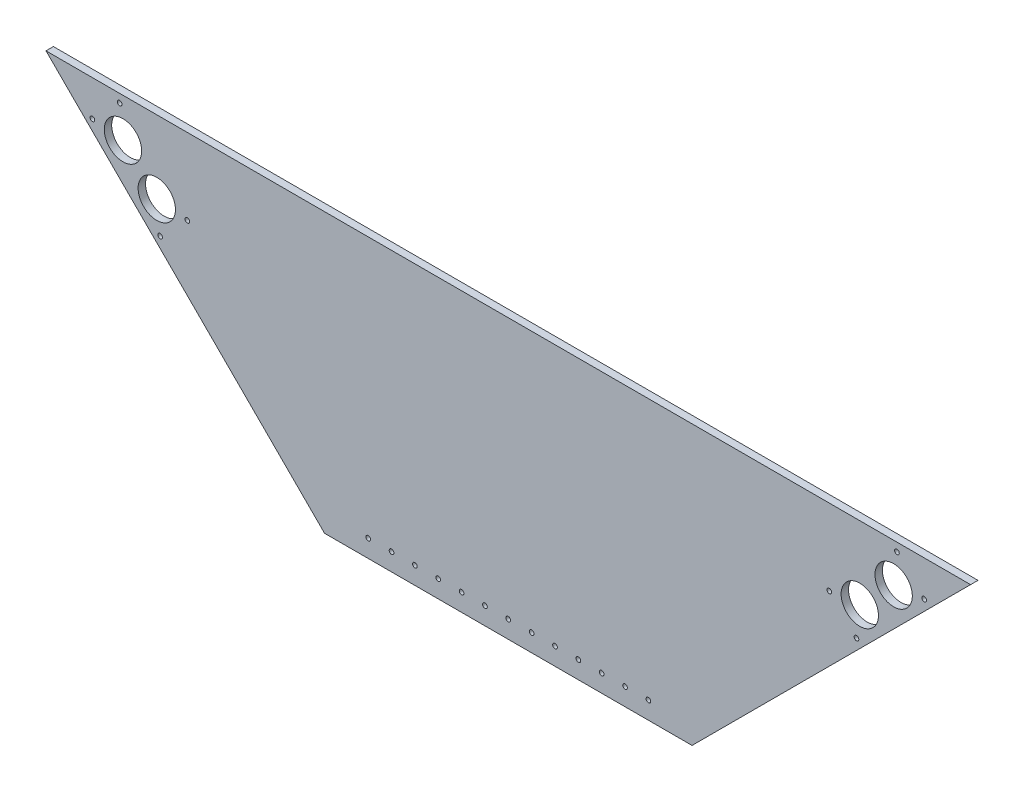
ISO-10303-21;
HEADER;
FILE_DESCRIPTION(('STEP AP214'),'2;1');
FILE_NAME('part.step','',(''),(''),'','','');
FILE_SCHEMA(('AUTOMOTIVE_DESIGN { 1 0 10303 214 1 1 1 1 }'));
ENDSEC;
DATA;
#1=APPLICATION_CONTEXT('core data for automotive mechanical design processes');
#2=APPLICATION_PROTOCOL_DEFINITION('international standard','automotive_design',2000,#1);
#3=PRODUCT_CONTEXT('',#1,'mechanical');
#4=PRODUCT('Part','Part','',(#3));
#5=PRODUCT_RELATED_PRODUCT_CATEGORY('part','',(#4));
#6=PRODUCT_DEFINITION_FORMATION('','',#4);
#7=PRODUCT_DEFINITION_CONTEXT('part definition',#1,'design');
#8=PRODUCT_DEFINITION('design','',#6,#7);
#9=PRODUCT_DEFINITION_SHAPE('','',#8);
#10=(LENGTH_UNIT() NAMED_UNIT(*) SI_UNIT(.MILLI.,.METRE.));
#11=(NAMED_UNIT(*) PLANE_ANGLE_UNIT() SI_UNIT($,.RADIAN.));
#12=(NAMED_UNIT(*) SI_UNIT($,.STERADIAN.) SOLID_ANGLE_UNIT());
#13=UNCERTAINTY_MEASURE_WITH_UNIT(LENGTH_MEASURE(1.E-05),#10,'distance_accuracy_value','');
#14=(GEOMETRIC_REPRESENTATION_CONTEXT(3) GLOBAL_UNCERTAINTY_ASSIGNED_CONTEXT((#13)) GLOBAL_UNIT_ASSIGNED_CONTEXT((#10,
#11,#12)) REPRESENTATION_CONTEXT('',''));
#15=CARTESIAN_POINT('',(0.,0.,0.));
#16=DIRECTION('',(0.,0.,1.));
#17=DIRECTION('',(1.,0.,0.));
#18=AXIS2_PLACEMENT_3D('',#15,#16,#17);
#19=CARTESIAN_POINT('',(-197.965,119.28,3.175));
#20=DIRECTION('',(0.,1.,0.));
#21=DIRECTION('',(-1.,0.,0.));
#22=AXIS2_PLACEMENT_3D('',#19,#20,#21);
#23=PLANE('',#22);
#24=DIRECTION('',(1.,0.,0.));
#25=VECTOR('',#24,1.);
#26=CARTESIAN_POINT('',(-197.965,119.28,0.));
#27=LINE('',#26,#25);
#28=CARTESIAN_POINT('',(-197.965,119.28,0.));
#29=VERTEX_POINT('',#28);
#30=CARTESIAN_POINT('',(197.965,119.28,0.));
#31=VERTEX_POINT('',#30);
#32=EDGE_CURVE('E112',#29,#31,#27,.T.);
#33=ORIENTED_EDGE('',*,*,#32,.F.);
#34=DIRECTION('',(0.,0.,-1.));
#35=VECTOR('',#34,1.);
#36=CARTESIAN_POINT('',(-197.965,119.28,3.175));
#37=LINE('',#36,#35);
#38=CARTESIAN_POINT('',(-197.965,119.28,3.175));
#39=VERTEX_POINT('',#38);
#40=EDGE_CURVE('E11',#39,#29,#37,.T.);
#41=ORIENTED_EDGE('',*,*,#40,.F.);
#42=DIRECTION('',(1.,0.,0.));
#43=VECTOR('',#42,1.);
#44=CARTESIAN_POINT('',(-197.965,119.28,3.175));
#45=LINE('',#44,#43);
#46=CARTESIAN_POINT('',(197.965,119.28,3.175));
#47=VERTEX_POINT('',#46);
#48=EDGE_CURVE('E104',#39,#47,#45,.T.);
#49=ORIENTED_EDGE('',*,*,#48,.T.);
#50=DIRECTION('',(0.,0.,-1.));
#51=VECTOR('',#50,1.);
#52=CARTESIAN_POINT('',(197.965,119.28,3.175));
#53=LINE('',#52,#51);
#54=EDGE_CURVE('E43',#47,#31,#53,.T.);
#55=ORIENTED_EDGE('',*,*,#54,.T.);
#56=EDGE_LOOP('',(#33,#41,#49,#55));
#57=FACE_BOUND('',#56,.T.);
#58=ADVANCED_FACE('F40',(#57),#23,.T.);
#59=CARTESIAN_POINT('',(-197.965,119.28,3.175));
#60=DIRECTION('',(0.707106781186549,0.707106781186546,0.));
#61=DIRECTION('',(-0.707106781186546,0.707106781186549,0.));
#62=AXIS2_PLACEMENT_3D('',#59,#60,#61);
#63=PLANE('',#62);
#64=DIRECTION('',(0.707106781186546,-0.707106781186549,0.));
#65=VECTOR('',#64,1.);
#66=CARTESIAN_POINT('',(-197.965,119.28,0.));
#67=LINE('',#66,#65);
#68=CARTESIAN_POINT('',(-78.685,0.,0.));
#69=VERTEX_POINT('',#68);
#70=EDGE_CURVE('E74',#29,#69,#67,.T.);
#71=ORIENTED_EDGE('',*,*,#70,.T.);
#72=DIRECTION('',(0.,0.,-1.));
#73=VECTOR('',#72,1.);
#74=CARTESIAN_POINT('',(-78.685,0.,3.175));
#75=LINE('',#74,#73);
#76=CARTESIAN_POINT('',(-78.685,0.,3.175));
#77=VERTEX_POINT('',#76);
#78=EDGE_CURVE('E50',#77,#69,#75,.T.);
#79=ORIENTED_EDGE('',*,*,#78,.F.);
#80=DIRECTION('',(0.707106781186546,-0.707106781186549,0.));
#81=VECTOR('',#80,1.);
#82=CARTESIAN_POINT('',(-197.965,119.28,3.175));
#83=LINE('',#82,#81);
#84=EDGE_CURVE('E91',#39,#77,#83,.T.);
#85=ORIENTED_EDGE('',*,*,#84,.F.);
#86=ORIENTED_EDGE('',*,*,#40,.T.);
#87=EDGE_LOOP('',(#71,#79,#85,#86));
#88=FACE_BOUND('',#87,.T.);
#89=ADVANCED_FACE('F129',(#88),#63,.F.);
#90=CARTESIAN_POINT('',(-78.685,0.,3.175));
#91=DIRECTION('',(0.,1.,0.));
#92=DIRECTION('',(-1.,0.,0.));
#93=AXIS2_PLACEMENT_3D('',#90,#91,#92);
#94=PLANE('',#93);
#95=DIRECTION('',(1.,0.,0.));
#96=VECTOR('',#95,1.);
#97=CARTESIAN_POINT('',(-78.685,0.,0.));
#98=LINE('',#97,#96);
#99=CARTESIAN_POINT('',(78.685,0.,0.));
#100=VERTEX_POINT('',#99);
#101=EDGE_CURVE('E99',#69,#100,#98,.T.);
#102=ORIENTED_EDGE('',*,*,#101,.T.);
#103=DIRECTION('',(0.,0.,-1.));
#104=VECTOR('',#103,1.);
#105=CARTESIAN_POINT('',(78.685,0.,3.175));
#106=LINE('',#105,#104);
#107=CARTESIAN_POINT('',(78.685,0.,3.175));
#108=VERTEX_POINT('',#107);
#109=EDGE_CURVE('E96',#108,#100,#106,.T.);
#110=ORIENTED_EDGE('',*,*,#109,.F.);
#111=DIRECTION('',(1.,0.,0.));
#112=VECTOR('',#111,1.);
#113=CARTESIAN_POINT('',(-78.685,0.,3.175));
#114=LINE('',#113,#112);
#115=EDGE_CURVE('E86',#77,#108,#114,.T.);
#116=ORIENTED_EDGE('',*,*,#115,.F.);
#117=ORIENTED_EDGE('',*,*,#78,.T.);
#118=EDGE_LOOP('',(#102,#110,#116,#117));
#119=FACE_BOUND('',#118,.T.);
#120=ADVANCED_FACE('F97',(#119),#94,.F.);
#121=CARTESIAN_POINT('',(197.965,119.28,3.175));
#122=DIRECTION('',(0.707106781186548,-0.707106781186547,0.));
#123=DIRECTION('',(0.707106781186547,0.707106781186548,0.));
#124=AXIS2_PLACEMENT_3D('',#121,#122,#123);
#125=PLANE('',#124);
#126=DIRECTION('',(-0.707106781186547,-0.707106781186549,0.));
#127=VECTOR('',#126,1.);
#128=CARTESIAN_POINT('',(197.965,119.28,0.));
#129=LINE('',#128,#127);
#130=EDGE_CURVE('E116',#31,#100,#129,.T.);
#131=ORIENTED_EDGE('',*,*,#130,.F.);
#132=ORIENTED_EDGE('',*,*,#54,.F.);
#133=DIRECTION('',(-0.707106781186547,-0.707106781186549,0.));
#134=VECTOR('',#133,1.);
#135=CARTESIAN_POINT('',(197.965,119.28,3.175));
#136=LINE('',#135,#134);
#137=EDGE_CURVE('E90',#47,#108,#136,.T.);
#138=ORIENTED_EDGE('',*,*,#137,.T.);
#139=ORIENTED_EDGE('',*,*,#109,.T.);
#140=EDGE_LOOP('',(#131,#132,#138,#139));
#141=FACE_BOUND('',#140,.T.);
#142=ADVANCED_FACE('F102',(#141),#125,.T.);
#143=CARTESIAN_POINT('',(0.,0.,3.175));
#144=DIRECTION('',(0.,0.,-1.));
#145=DIRECTION('',(-1.,0.,0.));
#146=AXIS2_PLACEMENT_3D('',#143,#144,#145);
#147=PLANE('',#146);
#148=CARTESIAN_POINT('',(178.096235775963,104.0032301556,3.175));
#149=DIRECTION('',(0.,0.,-1.));
#150=DIRECTION('',(-1.,0.,0.));
#151=AXIS2_PLACEMENT_3D('',#148,#149,#150);
#152=CIRCLE('',#151,0.999999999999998);
#153=CARTESIAN_POINT('',(177.096235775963,104.0032301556,3.175));
#154=VERTEX_POINT('',#153);
#155=EDGE_CURVE('E273',#154,#154,#152,.T.);
#156=ORIENTED_EDGE('',*,*,#155,.T.);
#157=EDGE_LOOP('',(#156));
#158=FACE_BOUND('',#157,.T.);
#159=CARTESIAN_POINT('',(166.428973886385,115.670492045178,3.175));
#160=DIRECTION('',(0.,0.,-1.));
#161=DIRECTION('',(-1.,0.,0.));
#162=AXIS2_PLACEMENT_3D('',#159,#160,#161);
#163=CIRCLE('',#162,0.999999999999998);
#164=CARTESIAN_POINT('',(165.428973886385,115.670492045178,3.175));
#165=VERTEX_POINT('',#164);
#166=EDGE_CURVE('E280',#165,#165,#163,.T.);
#167=ORIENTED_EDGE('',*,*,#166,.T.);
#168=EDGE_LOOP('',(#167));
#169=FACE_BOUND('',#168,.T.);
#170=CARTESIAN_POINT('',(137.437595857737,86.6791140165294,3.175));
#171=DIRECTION('',(0.,0.,-1.));
#172=DIRECTION('',(1.,0.,0.));
#173=AXIS2_PLACEMENT_3D('',#170,#171,#172);
#174=CIRCLE('',#173,1.00000000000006);
#175=CARTESIAN_POINT('',(138.437595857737,86.6791140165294,3.175));
#176=VERTEX_POINT('',#175);
#177=EDGE_CURVE('E288',#176,#176,#174,.T.);
#178=ORIENTED_EDGE('',*,*,#177,.T.);
#179=EDGE_LOOP('',(#178));
#180=FACE_BOUND('',#179,.T.);
#181=CARTESIAN_POINT('',(149.104857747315,75.0118521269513,3.175));
#182=DIRECTION('',(0.,0.,-1.));
#183=DIRECTION('',(1.,0.,0.));
#184=AXIS2_PLACEMENT_3D('',#181,#182,#183);
#185=CIRCLE('',#184,1.00000000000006);
#186=CARTESIAN_POINT('',(150.104857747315,75.0118521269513,3.175));
#187=VERTEX_POINT('',#186);
#188=EDGE_CURVE('E265',#187,#187,#185,.T.);
#189=ORIENTED_EDGE('',*,*,#188,.T.);
#190=EDGE_LOOP('',(#189));
#191=FACE_BOUND('',#190,.T.);
#192=CARTESIAN_POINT('',(150.519071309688,88.0933275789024,3.175));
#193=DIRECTION('',(0.,0.,-1.));
#194=DIRECTION('',(1.,0.,0.));
#195=AXIS2_PLACEMENT_3D('',#192,#193,#194);
#196=CIRCLE('',#195,8.00000000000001);
#197=CARTESIAN_POINT('',(158.519071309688,88.0933275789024,3.175));
#198=VERTEX_POINT('',#197);
#199=EDGE_CURVE('E260',#198,#198,#196,.T.);
#200=ORIENTED_EDGE('',*,*,#199,.T.);
#201=EDGE_LOOP('',(#200));
#202=FACE_BOUND('',#201,.T.);
#203=CARTESIAN_POINT('',(165.014760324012,102.589016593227,3.175));
#204=DIRECTION('',(0.,0.,-1.));
#205=DIRECTION('',(-1.,0.,0.));
#206=AXIS2_PLACEMENT_3D('',#203,#204,#205);
#207=CIRCLE('',#206,8.00000000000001);
#208=CARTESIAN_POINT('',(157.014760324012,102.589016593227,3.175));
#209=VERTEX_POINT('',#208);
#210=EDGE_CURVE('E272',#209,#209,#207,.T.);
#211=ORIENTED_EDGE('',*,*,#210,.T.);
#212=EDGE_LOOP('',(#211));
#213=FACE_BOUND('',#212,.T.);
#214=CARTESIAN_POINT('',(-178.096235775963,104.0032301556,3.175));
#215=DIRECTION('',(0.,0.,1.));
#216=DIRECTION('',(1.,0.,0.));
#217=AXIS2_PLACEMENT_3D('',#214,#215,#216);
#218=CIRCLE('',#217,0.999999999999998);
#219=CARTESIAN_POINT('',(-177.096235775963,104.0032301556,3.175));
#220=VERTEX_POINT('',#219);
#221=EDGE_CURVE('E320',#220,#220,#218,.T.);
#222=ORIENTED_EDGE('',*,*,#221,.F.);
#223=EDGE_LOOP('',(#222));
#224=FACE_BOUND('',#223,.T.);
#225=CARTESIAN_POINT('',(-166.428973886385,115.670492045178,3.175));
#226=DIRECTION('',(0.,0.,1.));
#227=DIRECTION('',(1.,0.,0.));
#228=AXIS2_PLACEMENT_3D('',#225,#226,#227);
#229=CIRCLE('',#228,0.999999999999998);
#230=CARTESIAN_POINT('',(-165.428973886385,115.670492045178,3.175));
#231=VERTEX_POINT('',#230);
#232=EDGE_CURVE('E328',#231,#231,#229,.T.);
#233=ORIENTED_EDGE('',*,*,#232,.F.);
#234=EDGE_LOOP('',(#233));
#235=FACE_BOUND('',#234,.T.);
#236=CARTESIAN_POINT('',(-137.437595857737,86.6791140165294,3.175));
#237=DIRECTION('',(0.,0.,1.));
#238=DIRECTION('',(-1.,0.,0.));
#239=AXIS2_PLACEMENT_3D('',#236,#237,#238);
#240=CIRCLE('',#239,1.00000000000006);
#241=CARTESIAN_POINT('',(-138.437595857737,86.6791140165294,3.175));
#242=VERTEX_POINT('',#241);
#243=EDGE_CURVE('E336',#242,#242,#240,.T.);
#244=ORIENTED_EDGE('',*,*,#243,.F.);
#245=EDGE_LOOP('',(#244));
#246=FACE_BOUND('',#245,.T.);
#247=CARTESIAN_POINT('',(-149.104857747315,75.0118521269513,3.175));
#248=DIRECTION('',(0.,0.,1.));
#249=DIRECTION('',(-1.,0.,0.));
#250=AXIS2_PLACEMENT_3D('',#247,#248,#249);
#251=CIRCLE('',#250,1.00000000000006);
#252=CARTESIAN_POINT('',(-150.104857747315,75.0118521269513,3.175));
#253=VERTEX_POINT('',#252);
#254=EDGE_CURVE('E311',#253,#253,#251,.T.);
#255=ORIENTED_EDGE('',*,*,#254,.F.);
#256=EDGE_LOOP('',(#255));
#257=FACE_BOUND('',#256,.T.);
#258=CARTESIAN_POINT('',(-150.519071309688,88.0933275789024,3.175));
#259=DIRECTION('',(0.,0.,1.));
#260=DIRECTION('',(-1.,0.,0.));
#261=AXIS2_PLACEMENT_3D('',#258,#259,#260);
#262=CIRCLE('',#261,8.00000000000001);
#263=CARTESIAN_POINT('',(-158.519071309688,88.0933275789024,3.175));
#264=VERTEX_POINT('',#263);
#265=EDGE_CURVE('E303',#264,#264,#262,.T.);
#266=ORIENTED_EDGE('',*,*,#265,.F.);
#267=EDGE_LOOP('',(#266));
#268=FACE_BOUND('',#267,.T.);
#269=CARTESIAN_POINT('',(-165.014760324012,102.589016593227,3.175));
#270=DIRECTION('',(0.,0.,1.));
#271=DIRECTION('',(1.,0.,0.));
#272=AXIS2_PLACEMENT_3D('',#269,#270,#271);
#273=CIRCLE('',#272,8.00000000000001);
#274=CARTESIAN_POINT('',(-157.014760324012,102.589016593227,3.175));
#275=VERTEX_POINT('',#274);
#276=EDGE_CURVE('E319',#275,#275,#273,.T.);
#277=ORIENTED_EDGE('',*,*,#276,.F.);
#278=EDGE_LOOP('',(#277));
#279=FACE_BOUND('',#278,.T.);
#280=CARTESIAN_POINT('',(-60.,7.49999999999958,3.175));
#281=DIRECTION('',(0.,0.,1.));
#282=DIRECTION('',(1.,0.,0.));
#283=AXIS2_PLACEMENT_3D('',#280,#281,#282);
#284=CIRCLE('',#283,0.999999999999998);
#285=CARTESIAN_POINT('',(-59.,7.49999999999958,3.175));
#286=VERTEX_POINT('',#285);
#287=EDGE_CURVE('E351',#286,#286,#284,.T.);
#288=ORIENTED_EDGE('',*,*,#287,.F.);
#289=EDGE_LOOP('',(#288));
#290=FACE_BOUND('',#289,.T.);
#291=CARTESIAN_POINT('',(-50.,7.49999999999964,3.175));
#292=DIRECTION('',(0.,0.,1.));
#293=DIRECTION('',(1.,0.,0.));
#294=AXIS2_PLACEMENT_3D('',#291,#292,#293);
#295=CIRCLE('',#294,0.999999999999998);
#296=CARTESIAN_POINT('',(-49.,7.49999999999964,3.175));
#297=VERTEX_POINT('',#296);
#298=EDGE_CURVE('E440',#297,#297,#295,.T.);
#299=ORIENTED_EDGE('',*,*,#298,.F.);
#300=EDGE_LOOP('',(#299));
#301=FACE_BOUND('',#300,.T.);
#302=CARTESIAN_POINT('',(-40.,7.49999999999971,3.175));
#303=DIRECTION('',(0.,0.,1.));
#304=DIRECTION('',(1.,0.,0.));
#305=AXIS2_PLACEMENT_3D('',#302,#303,#304);
#306=CIRCLE('',#305,0.999999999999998);
#307=CARTESIAN_POINT('',(-39.,7.49999999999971,3.175));
#308=VERTEX_POINT('',#307);
#309=EDGE_CURVE('E432',#308,#308,#306,.T.);
#310=ORIENTED_EDGE('',*,*,#309,.F.);
#311=EDGE_LOOP('',(#310));
#312=FACE_BOUND('',#311,.T.);
#313=CARTESIAN_POINT('',(-30.,7.49999999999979,3.175));
#314=DIRECTION('',(0.,0.,1.));
#315=DIRECTION('',(1.,0.,0.));
#316=AXIS2_PLACEMENT_3D('',#313,#314,#315);
#317=CIRCLE('',#316,1.);
#318=CARTESIAN_POINT('',(-29.,7.49999999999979,3.175));
#319=VERTEX_POINT('',#318);
#320=EDGE_CURVE('E424',#319,#319,#317,.T.);
#321=ORIENTED_EDGE('',*,*,#320,.F.);
#322=EDGE_LOOP('',(#321));
#323=FACE_BOUND('',#322,.T.);
#324=CARTESIAN_POINT('',(10.,7.49999999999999,3.175));
#325=DIRECTION('',(0.,0.,1.));
#326=DIRECTION('',(1.,0.,0.));
#327=AXIS2_PLACEMENT_3D('',#324,#325,#326);
#328=CIRCLE('',#327,1.);
#329=CARTESIAN_POINT('',(11.,7.49999999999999,3.175));
#330=VERTEX_POINT('',#329);
#331=EDGE_CURVE('E394',#330,#330,#328,.T.);
#332=ORIENTED_EDGE('',*,*,#331,.F.);
#333=EDGE_LOOP('',(#332));
#334=FACE_BOUND('',#333,.T.);
#335=CARTESIAN_POINT('',(20.,7.49999999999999,3.175));
#336=DIRECTION('',(0.,0.,1.));
#337=DIRECTION('',(1.,0.,0.));
#338=AXIS2_PLACEMENT_3D('',#335,#336,#337);
#339=CIRCLE('',#338,1.);
#340=CARTESIAN_POINT('',(21.,7.49999999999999,3.175));
#341=VERTEX_POINT('',#340);
#342=EDGE_CURVE('E402',#341,#341,#339,.T.);
#343=ORIENTED_EDGE('',*,*,#342,.F.);
#344=EDGE_LOOP('',(#343));
#345=FACE_BOUND('',#344,.T.);
#346=CARTESIAN_POINT('',(30.,7.49999999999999,3.175));
#347=DIRECTION('',(0.,0.,1.));
#348=DIRECTION('',(1.,0.,0.));
#349=AXIS2_PLACEMENT_3D('',#346,#347,#348);
#350=CIRCLE('',#349,1.);
#351=CARTESIAN_POINT('',(31.,7.49999999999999,3.175));
#352=VERTEX_POINT('',#351);
#353=EDGE_CURVE('E410',#352,#352,#350,.T.);
#354=ORIENTED_EDGE('',*,*,#353,.F.);
#355=EDGE_LOOP('',(#354));
#356=FACE_BOUND('',#355,.T.);
#357=CARTESIAN_POINT('',(40.,7.49999999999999,3.175));
#358=DIRECTION('',(0.,0.,1.));
#359=DIRECTION('',(1.,0.,0.));
#360=AXIS2_PLACEMENT_3D('',#357,#358,#359);
#361=CIRCLE('',#360,0.999999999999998);
#362=CARTESIAN_POINT('',(41.,7.49999999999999,3.175));
#363=VERTEX_POINT('',#362);
#364=EDGE_CURVE('E359',#363,#363,#361,.T.);
#365=ORIENTED_EDGE('',*,*,#364,.F.);
#366=EDGE_LOOP('',(#365));
#367=FACE_BOUND('',#366,.T.);
#368=CARTESIAN_POINT('',(50.,7.49999999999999,3.175));
#369=DIRECTION('',(0.,0.,1.));
#370=DIRECTION('',(1.,0.,0.));
#371=AXIS2_PLACEMENT_3D('',#368,#369,#370);
#372=CIRCLE('',#371,0.999999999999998);
#373=CARTESIAN_POINT('',(51.,7.49999999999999,3.175));
#374=VERTEX_POINT('',#373);
#375=EDGE_CURVE('E360',#374,#374,#372,.T.);
#376=ORIENTED_EDGE('',*,*,#375,.F.);
#377=EDGE_LOOP('',(#376));
#378=FACE_BOUND('',#377,.T.);
#379=CARTESIAN_POINT('',(60.,7.49999999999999,3.175));
#380=DIRECTION('',(0.,0.,1.));
#381=DIRECTION('',(1.,0.,0.));
#382=AXIS2_PLACEMENT_3D('',#379,#380,#381);
#383=CIRCLE('',#382,0.999999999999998);
#384=CARTESIAN_POINT('',(61.,7.49999999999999,3.175));
#385=VERTEX_POINT('',#384);
#386=EDGE_CURVE('E368',#385,#385,#383,.T.);
#387=ORIENTED_EDGE('',*,*,#386,.F.);
#388=EDGE_LOOP('',(#387));
#389=FACE_BOUND('',#388,.T.);
#390=CARTESIAN_POINT('',(-10.,7.49999999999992,3.175));
#391=DIRECTION('',(0.,0.,1.));
#392=DIRECTION('',(1.,0.,0.));
#393=AXIS2_PLACEMENT_3D('',#390,#391,#392);
#394=CIRCLE('',#393,1.);
#395=CARTESIAN_POINT('',(-9.,7.49999999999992,3.175));
#396=VERTEX_POINT('',#395);
#397=EDGE_CURVE('E376',#396,#396,#394,.T.);
#398=ORIENTED_EDGE('',*,*,#397,.F.);
#399=EDGE_LOOP('',(#398));
#400=FACE_BOUND('',#399,.T.);
#401=CARTESIAN_POINT('',(-20.,7.49999999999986,3.175));
#402=DIRECTION('',(0.,0.,1.));
#403=DIRECTION('',(1.,0.,0.));
#404=AXIS2_PLACEMENT_3D('',#401,#402,#403);
#405=CIRCLE('',#404,1.);
#406=CARTESIAN_POINT('',(-19.,7.49999999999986,3.175));
#407=VERTEX_POINT('',#406);
#408=EDGE_CURVE('E384',#407,#407,#405,.T.);
#409=ORIENTED_EDGE('',*,*,#408,.F.);
#410=EDGE_LOOP('',(#409));
#411=FACE_BOUND('',#410,.T.);
#412=CARTESIAN_POINT('',(0.,7.49999999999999,3.175));
#413=DIRECTION('',(0.,0.,1.));
#414=DIRECTION('',(1.,0.,0.));
#415=AXIS2_PLACEMENT_3D('',#412,#413,#414);
#416=CIRCLE('',#415,1.);
#417=CARTESIAN_POINT('',(1.,7.49999999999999,3.175));
#418=VERTEX_POINT('',#417);
#419=EDGE_CURVE('E393',#418,#418,#416,.T.);
#420=ORIENTED_EDGE('',*,*,#419,.F.);
#421=EDGE_LOOP('',(#420));
#422=FACE_BOUND('',#421,.T.);
#423=ORIENTED_EDGE('',*,*,#48,.F.);
#424=ORIENTED_EDGE('',*,*,#84,.T.);
#425=ORIENTED_EDGE('',*,*,#115,.T.);
#426=ORIENTED_EDGE('',*,*,#137,.F.);
#427=EDGE_LOOP('',(#423,#424,#425,#426));
#428=FACE_BOUND('',#427,.T.);
#429=ADVANCED_FACE('F89',(#158,#169,#180,#191,#202,#213,#224,#235,#246,#257,#268,#279,#290,#301,
#312,#323,#334,#345,#356,#367,#378,#389,#400,#411,#422,#428),#147,.F.);
#430=CARTESIAN_POINT('',(0.,0.,0.));
#431=DIRECTION('',(0.,0.,-1.));
#432=DIRECTION('',(-1.,0.,0.));
#433=AXIS2_PLACEMENT_3D('',#430,#431,#432);
#434=PLANE('',#433);
#435=CARTESIAN_POINT('',(178.096235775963,104.0032301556,0.));
#436=DIRECTION('',(0.,0.,-1.));
#437=DIRECTION('',(-1.,0.,0.));
#438=AXIS2_PLACEMENT_3D('',#435,#436,#437);
#439=CIRCLE('',#438,0.999999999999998);
#440=CARTESIAN_POINT('',(177.096235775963,104.0032301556,0.));
#441=VERTEX_POINT('',#440);
#442=EDGE_CURVE('E268',#441,#441,#439,.T.);
#443=ORIENTED_EDGE('',*,*,#442,.F.);
#444=EDGE_LOOP('',(#443));
#445=FACE_BOUND('',#444,.T.);
#446=CARTESIAN_POINT('',(166.428973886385,115.670492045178,0.));
#447=DIRECTION('',(0.,0.,-1.));
#448=DIRECTION('',(-1.,0.,0.));
#449=AXIS2_PLACEMENT_3D('',#446,#447,#448);
#450=CIRCLE('',#449,0.999999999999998);
#451=CARTESIAN_POINT('',(165.428973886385,115.670492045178,0.));
#452=VERTEX_POINT('',#451);
#453=EDGE_CURVE('E276',#452,#452,#450,.T.);
#454=ORIENTED_EDGE('',*,*,#453,.F.);
#455=EDGE_LOOP('',(#454));
#456=FACE_BOUND('',#455,.T.);
#457=CARTESIAN_POINT('',(137.437595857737,86.6791140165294,0.));
#458=DIRECTION('',(0.,0.,-1.));
#459=DIRECTION('',(1.,0.,0.));
#460=AXIS2_PLACEMENT_3D('',#457,#458,#459);
#461=CIRCLE('',#460,1.00000000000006);
#462=CARTESIAN_POINT('',(138.437595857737,86.6791140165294,0.));
#463=VERTEX_POINT('',#462);
#464=EDGE_CURVE('E284',#463,#463,#461,.T.);
#465=ORIENTED_EDGE('',*,*,#464,.F.);
#466=EDGE_LOOP('',(#465));
#467=FACE_BOUND('',#466,.T.);
#468=CARTESIAN_POINT('',(149.104857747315,75.0118521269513,0.));
#469=DIRECTION('',(0.,0.,-1.));
#470=DIRECTION('',(1.,0.,0.));
#471=AXIS2_PLACEMENT_3D('',#468,#469,#470);
#472=CIRCLE('',#471,1.00000000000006);
#473=CARTESIAN_POINT('',(150.104857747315,75.0118521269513,0.));
#474=VERTEX_POINT('',#473);
#475=EDGE_CURVE('E292',#474,#474,#472,.T.);
#476=ORIENTED_EDGE('',*,*,#475,.F.);
#477=EDGE_LOOP('',(#476));
#478=FACE_BOUND('',#477,.T.);
#479=CARTESIAN_POINT('',(150.519071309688,88.0933275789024,0.));
#480=DIRECTION('',(0.,0.,-1.));
#481=DIRECTION('',(1.,0.,0.));
#482=AXIS2_PLACEMENT_3D('',#479,#480,#481);
#483=CIRCLE('',#482,8.00000000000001);
#484=CARTESIAN_POINT('',(158.519071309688,88.0933275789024,0.));
#485=VERTEX_POINT('',#484);
#486=EDGE_CURVE('E257',#485,#485,#483,.T.);
#487=ORIENTED_EDGE('',*,*,#486,.F.);
#488=EDGE_LOOP('',(#487));
#489=FACE_BOUND('',#488,.T.);
#490=CARTESIAN_POINT('',(165.014760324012,102.589016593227,0.));
#491=DIRECTION('',(0.,0.,-1.));
#492=DIRECTION('',(-1.,0.,0.));
#493=AXIS2_PLACEMENT_3D('',#490,#491,#492);
#494=CIRCLE('',#493,8.00000000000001);
#495=CARTESIAN_POINT('',(157.014760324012,102.589016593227,0.));
#496=VERTEX_POINT('',#495);
#497=EDGE_CURVE('E299',#496,#496,#494,.T.);
#498=ORIENTED_EDGE('',*,*,#497,.F.);
#499=EDGE_LOOP('',(#498));
#500=FACE_BOUND('',#499,.T.);
#501=CARTESIAN_POINT('',(-178.096235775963,104.0032301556,0.));
#502=DIRECTION('',(0.,0.,1.));
#503=DIRECTION('',(1.,0.,0.));
#504=AXIS2_PLACEMENT_3D('',#501,#502,#503);
#505=CIRCLE('',#504,0.999999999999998);
#506=CARTESIAN_POINT('',(-177.096235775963,104.0032301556,0.));
#507=VERTEX_POINT('',#506);
#508=EDGE_CURVE('E315',#507,#507,#505,.T.);
#509=ORIENTED_EDGE('',*,*,#508,.T.);
#510=EDGE_LOOP('',(#509));
#511=FACE_BOUND('',#510,.T.);
#512=CARTESIAN_POINT('',(-166.428973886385,115.670492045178,0.));
#513=DIRECTION('',(0.,0.,1.));
#514=DIRECTION('',(1.,0.,0.));
#515=AXIS2_PLACEMENT_3D('',#512,#513,#514);
#516=CIRCLE('',#515,0.999999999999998);
#517=CARTESIAN_POINT('',(-165.428973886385,115.670492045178,0.));
#518=VERTEX_POINT('',#517);
#519=EDGE_CURVE('E324',#518,#518,#516,.T.);
#520=ORIENTED_EDGE('',*,*,#519,.T.);
#521=EDGE_LOOP('',(#520));
#522=FACE_BOUND('',#521,.T.);
#523=CARTESIAN_POINT('',(-137.437595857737,86.6791140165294,0.));
#524=DIRECTION('',(0.,0.,1.));
#525=DIRECTION('',(-1.,0.,0.));
#526=AXIS2_PLACEMENT_3D('',#523,#524,#525);
#527=CIRCLE('',#526,1.00000000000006);
#528=CARTESIAN_POINT('',(-138.437595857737,86.6791140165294,0.));
#529=VERTEX_POINT('',#528);
#530=EDGE_CURVE('E332',#529,#529,#527,.T.);
#531=ORIENTED_EDGE('',*,*,#530,.T.);
#532=EDGE_LOOP('',(#531));
#533=FACE_BOUND('',#532,.T.);
#534=CARTESIAN_POINT('',(-149.104857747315,75.0118521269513,0.));
#535=DIRECTION('',(0.,0.,1.));
#536=DIRECTION('',(-1.,0.,0.));
#537=AXIS2_PLACEMENT_3D('',#534,#535,#536);
#538=CIRCLE('',#537,1.00000000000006);
#539=CARTESIAN_POINT('',(-150.104857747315,75.0118521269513,0.));
#540=VERTEX_POINT('',#539);
#541=EDGE_CURVE('E340',#540,#540,#538,.T.);
#542=ORIENTED_EDGE('',*,*,#541,.T.);
#543=EDGE_LOOP('',(#542));
#544=FACE_BOUND('',#543,.T.);
#545=CARTESIAN_POINT('',(-150.519071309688,88.0933275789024,0.));
#546=DIRECTION('',(0.,0.,1.));
#547=DIRECTION('',(-1.,0.,0.));
#548=AXIS2_PLACEMENT_3D('',#545,#546,#547);
#549=CIRCLE('',#548,8.00000000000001);
#550=CARTESIAN_POINT('',(-158.519071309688,88.0933275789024,0.));
#551=VERTEX_POINT('',#550);
#552=EDGE_CURVE('E307',#551,#551,#549,.T.);
#553=ORIENTED_EDGE('',*,*,#552,.T.);
#554=EDGE_LOOP('',(#553));
#555=FACE_BOUND('',#554,.T.);
#556=CARTESIAN_POINT('',(-165.014760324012,102.589016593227,0.));
#557=DIRECTION('',(0.,0.,1.));
#558=DIRECTION('',(1.,0.,0.));
#559=AXIS2_PLACEMENT_3D('',#556,#557,#558);
#560=CIRCLE('',#559,8.00000000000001);
#561=CARTESIAN_POINT('',(-157.014760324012,102.589016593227,0.));
#562=VERTEX_POINT('',#561);
#563=EDGE_CURVE('E347',#562,#562,#560,.T.);
#564=ORIENTED_EDGE('',*,*,#563,.T.);
#565=EDGE_LOOP('',(#564));
#566=FACE_BOUND('',#565,.T.);
#567=CARTESIAN_POINT('',(-60.,7.49999999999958,0.));
#568=DIRECTION('',(0.,0.,1.));
#569=DIRECTION('',(1.,0.,0.));
#570=AXIS2_PLACEMENT_3D('',#567,#568,#569);
#571=CIRCLE('',#570,0.999999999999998);
#572=CARTESIAN_POINT('',(-59.,7.49999999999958,0.));
#573=VERTEX_POINT('',#572);
#574=EDGE_CURVE('E444',#573,#573,#571,.T.);
#575=ORIENTED_EDGE('',*,*,#574,.T.);
#576=EDGE_LOOP('',(#575));
#577=FACE_BOUND('',#576,.T.);
#578=CARTESIAN_POINT('',(-50.,7.49999999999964,0.));
#579=DIRECTION('',(0.,0.,1.));
#580=DIRECTION('',(1.,0.,0.));
#581=AXIS2_PLACEMENT_3D('',#578,#579,#580);
#582=CIRCLE('',#581,0.999999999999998);
#583=CARTESIAN_POINT('',(-49.,7.49999999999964,0.));
#584=VERTEX_POINT('',#583);
#585=EDGE_CURVE('E436',#584,#584,#582,.T.);
#586=ORIENTED_EDGE('',*,*,#585,.T.);
#587=EDGE_LOOP('',(#586));
#588=FACE_BOUND('',#587,.T.);
#589=CARTESIAN_POINT('',(-40.,7.49999999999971,0.));
#590=DIRECTION('',(0.,0.,1.));
#591=DIRECTION('',(1.,0.,0.));
#592=AXIS2_PLACEMENT_3D('',#589,#590,#591);
#593=CIRCLE('',#592,0.999999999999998);
#594=CARTESIAN_POINT('',(-39.,7.49999999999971,0.));
#595=VERTEX_POINT('',#594);
#596=EDGE_CURVE('E428',#595,#595,#593,.T.);
#597=ORIENTED_EDGE('',*,*,#596,.T.);
#598=EDGE_LOOP('',(#597));
#599=FACE_BOUND('',#598,.T.);
#600=CARTESIAN_POINT('',(-30.,7.49999999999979,0.));
#601=DIRECTION('',(0.,0.,1.));
#602=DIRECTION('',(1.,0.,0.));
#603=AXIS2_PLACEMENT_3D('',#600,#601,#602);
#604=CIRCLE('',#603,1.);
#605=CARTESIAN_POINT('',(-29.,7.49999999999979,0.));
#606=VERTEX_POINT('',#605);
#607=EDGE_CURVE('E388',#606,#606,#604,.T.);
#608=ORIENTED_EDGE('',*,*,#607,.T.);
#609=EDGE_LOOP('',(#608));
#610=FACE_BOUND('',#609,.T.);
#611=CARTESIAN_POINT('',(10.,7.49999999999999,0.));
#612=DIRECTION('',(0.,0.,1.));
#613=DIRECTION('',(1.,0.,0.));
#614=AXIS2_PLACEMENT_3D('',#611,#612,#613);
#615=CIRCLE('',#614,1.);
#616=CARTESIAN_POINT('',(11.,7.49999999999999,0.));
#617=VERTEX_POINT('',#616);
#618=EDGE_CURVE('E389',#617,#617,#615,.T.);
#619=ORIENTED_EDGE('',*,*,#618,.T.);
#620=EDGE_LOOP('',(#619));
#621=FACE_BOUND('',#620,.T.);
#622=CARTESIAN_POINT('',(20.,7.49999999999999,0.));
#623=DIRECTION('',(0.,0.,1.));
#624=DIRECTION('',(1.,0.,0.));
#625=AXIS2_PLACEMENT_3D('',#622,#623,#624);
#626=CIRCLE('',#625,1.);
#627=CARTESIAN_POINT('',(21.,7.49999999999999,0.));
#628=VERTEX_POINT('',#627);
#629=EDGE_CURVE('E398',#628,#628,#626,.T.);
#630=ORIENTED_EDGE('',*,*,#629,.T.);
#631=EDGE_LOOP('',(#630));
#632=FACE_BOUND('',#631,.T.);
#633=CARTESIAN_POINT('',(30.,7.49999999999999,0.));
#634=DIRECTION('',(0.,0.,1.));
#635=DIRECTION('',(1.,0.,0.));
#636=AXIS2_PLACEMENT_3D('',#633,#634,#635);
#637=CIRCLE('',#636,1.);
#638=CARTESIAN_POINT('',(31.,7.49999999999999,0.));
#639=VERTEX_POINT('',#638);
#640=EDGE_CURVE('E406',#639,#639,#637,.T.);
#641=ORIENTED_EDGE('',*,*,#640,.T.);
#642=EDGE_LOOP('',(#641));
#643=FACE_BOUND('',#642,.T.);
#644=CARTESIAN_POINT('',(40.,7.49999999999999,0.));
#645=DIRECTION('',(0.,0.,1.));
#646=DIRECTION('',(1.,0.,0.));
#647=AXIS2_PLACEMENT_3D('',#644,#645,#646);
#648=CIRCLE('',#647,0.999999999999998);
#649=CARTESIAN_POINT('',(41.,7.49999999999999,0.));
#650=VERTEX_POINT('',#649);
#651=EDGE_CURVE('E414',#650,#650,#648,.T.);
#652=ORIENTED_EDGE('',*,*,#651,.T.);
#653=EDGE_LOOP('',(#652));
#654=FACE_BOUND('',#653,.T.);
#655=CARTESIAN_POINT('',(50.,7.49999999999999,0.));
#656=DIRECTION('',(0.,0.,1.));
#657=DIRECTION('',(1.,0.,0.));
#658=AXIS2_PLACEMENT_3D('',#655,#656,#657);
#659=CIRCLE('',#658,0.999999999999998);
#660=CARTESIAN_POINT('',(51.,7.49999999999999,0.));
#661=VERTEX_POINT('',#660);
#662=EDGE_CURVE('E355',#661,#661,#659,.T.);
#663=ORIENTED_EDGE('',*,*,#662,.T.);
#664=EDGE_LOOP('',(#663));
#665=FACE_BOUND('',#664,.T.);
#666=CARTESIAN_POINT('',(60.,7.49999999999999,0.));
#667=DIRECTION('',(0.,0.,1.));
#668=DIRECTION('',(1.,0.,0.));
#669=AXIS2_PLACEMENT_3D('',#666,#667,#668);
#670=CIRCLE('',#669,0.999999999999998);
#671=CARTESIAN_POINT('',(61.,7.49999999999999,0.));
#672=VERTEX_POINT('',#671);
#673=EDGE_CURVE('E364',#672,#672,#670,.T.);
#674=ORIENTED_EDGE('',*,*,#673,.T.);
#675=EDGE_LOOP('',(#674));
#676=FACE_BOUND('',#675,.T.);
#677=CARTESIAN_POINT('',(-10.,7.49999999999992,0.));
#678=DIRECTION('',(0.,0.,1.));
#679=DIRECTION('',(1.,0.,0.));
#680=AXIS2_PLACEMENT_3D('',#677,#678,#679);
#681=CIRCLE('',#680,1.);
#682=CARTESIAN_POINT('',(-9.,7.49999999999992,0.));
#683=VERTEX_POINT('',#682);
#684=EDGE_CURVE('E372',#683,#683,#681,.T.);
#685=ORIENTED_EDGE('',*,*,#684,.T.);
#686=EDGE_LOOP('',(#685));
#687=FACE_BOUND('',#686,.T.);
#688=CARTESIAN_POINT('',(-20.,7.49999999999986,0.));
#689=DIRECTION('',(0.,0.,1.));
#690=DIRECTION('',(1.,0.,0.));
#691=AXIS2_PLACEMENT_3D('',#688,#689,#690);
#692=CIRCLE('',#691,1.);
#693=CARTESIAN_POINT('',(-19.,7.49999999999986,0.));
#694=VERTEX_POINT('',#693);
#695=EDGE_CURVE('E380',#694,#694,#692,.T.);
#696=ORIENTED_EDGE('',*,*,#695,.T.);
#697=EDGE_LOOP('',(#696));
#698=FACE_BOUND('',#697,.T.);
#699=CARTESIAN_POINT('',(0.,7.49999999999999,0.));
#700=DIRECTION('',(0.,0.,1.));
#701=DIRECTION('',(1.,0.,0.));
#702=AXIS2_PLACEMENT_3D('',#699,#700,#701);
#703=CIRCLE('',#702,1.);
#704=CARTESIAN_POINT('',(1.,7.49999999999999,0.));
#705=VERTEX_POINT('',#704);
#706=EDGE_CURVE('E117',#705,#705,#703,.T.);
#707=ORIENTED_EDGE('',*,*,#706,.T.);
#708=EDGE_LOOP('',(#707));
#709=FACE_BOUND('',#708,.T.);
#710=ORIENTED_EDGE('',*,*,#32,.T.);
#711=ORIENTED_EDGE('',*,*,#130,.T.);
#712=ORIENTED_EDGE('',*,*,#101,.F.);
#713=ORIENTED_EDGE('',*,*,#70,.F.);
#714=EDGE_LOOP('',(#710,#711,#712,#713));
#715=FACE_BOUND('',#714,.T.);
#716=ADVANCED_FACE('F126',(#445,#456,#467,#478,#489,#500,#511,#522,#533,#544,#555,#566,#577,
#588,#599,#610,#621,#632,#643,#654,#665,#676,#687,#698,#709,#715),#434,.T.);
#717=CARTESIAN_POINT('',(0.,7.49999999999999,0.));
#718=DIRECTION('',(0.,0.,1.));
#719=DIRECTION('',(1.,0.,0.));
#720=AXIS2_PLACEMENT_3D('',#717,#718,#719);
#721=CYLINDRICAL_SURFACE('',#720,1.);
#722=ORIENTED_EDGE('',*,*,#706,.F.);
#723=EDGE_LOOP('',(#722));
#724=FACE_BOUND('',#723,.T.);
#725=ORIENTED_EDGE('',*,*,#419,.T.);
#726=EDGE_LOOP('',(#725));
#727=FACE_BOUND('',#726,.T.);
#728=ADVANCED_FACE('F149',(#724,#727),#721,.F.);
#729=CARTESIAN_POINT('',(-20.,7.49999999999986,0.));
#730=DIRECTION('',(0.,0.,1.));
#731=DIRECTION('',(1.,0.,0.));
#732=AXIS2_PLACEMENT_3D('',#729,#730,#731);
#733=CYLINDRICAL_SURFACE('',#732,1.);
#734=ORIENTED_EDGE('',*,*,#695,.F.);
#735=EDGE_LOOP('',(#734));
#736=FACE_BOUND('',#735,.T.);
#737=ORIENTED_EDGE('',*,*,#408,.T.);
#738=EDGE_LOOP('',(#737));
#739=FACE_BOUND('',#738,.T.);
#740=ADVANCED_FACE('F156',(#736,#739),#733,.F.);
#741=CARTESIAN_POINT('',(-10.,7.49999999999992,0.));
#742=DIRECTION('',(0.,0.,1.));
#743=DIRECTION('',(1.,0.,0.));
#744=AXIS2_PLACEMENT_3D('',#741,#742,#743);
#745=CYLINDRICAL_SURFACE('',#744,1.);
#746=ORIENTED_EDGE('',*,*,#684,.F.);
#747=EDGE_LOOP('',(#746));
#748=FACE_BOUND('',#747,.T.);
#749=ORIENTED_EDGE('',*,*,#397,.T.);
#750=EDGE_LOOP('',(#749));
#751=FACE_BOUND('',#750,.T.);
#752=ADVANCED_FACE('F194',(#748,#751),#745,.F.);
#753=CARTESIAN_POINT('',(60.,7.49999999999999,0.));
#754=DIRECTION('',(0.,0.,1.));
#755=DIRECTION('',(1.,0.,0.));
#756=AXIS2_PLACEMENT_3D('',#753,#754,#755);
#757=CYLINDRICAL_SURFACE('',#756,0.999999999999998);
#758=ORIENTED_EDGE('',*,*,#673,.F.);
#759=EDGE_LOOP('',(#758));
#760=FACE_BOUND('',#759,.T.);
#761=ORIENTED_EDGE('',*,*,#386,.T.);
#762=EDGE_LOOP('',(#761));
#763=FACE_BOUND('',#762,.T.);
#764=ADVANCED_FACE('F198',(#760,#763),#757,.F.);
#765=CARTESIAN_POINT('',(50.,7.49999999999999,0.));
#766=DIRECTION('',(0.,0.,1.));
#767=DIRECTION('',(1.,0.,0.));
#768=AXIS2_PLACEMENT_3D('',#765,#766,#767);
#769=CYLINDRICAL_SURFACE('',#768,0.999999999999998);
#770=ORIENTED_EDGE('',*,*,#662,.F.);
#771=EDGE_LOOP('',(#770));
#772=FACE_BOUND('',#771,.T.);
#773=ORIENTED_EDGE('',*,*,#375,.T.);
#774=EDGE_LOOP('',(#773));
#775=FACE_BOUND('',#774,.T.);
#776=ADVANCED_FACE('F180',(#772,#775),#769,.F.);
#777=CARTESIAN_POINT('',(40.,7.49999999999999,0.));
#778=DIRECTION('',(0.,0.,1.));
#779=DIRECTION('',(1.,0.,0.));
#780=AXIS2_PLACEMENT_3D('',#777,#778,#779);
#781=CYLINDRICAL_SURFACE('',#780,0.999999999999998);
#782=ORIENTED_EDGE('',*,*,#651,.F.);
#783=EDGE_LOOP('',(#782));
#784=FACE_BOUND('',#783,.T.);
#785=ORIENTED_EDGE('',*,*,#364,.T.);
#786=EDGE_LOOP('',(#785));
#787=FACE_BOUND('',#786,.T.);
#788=ADVANCED_FACE('F176',(#784,#787),#781,.F.);
#789=CARTESIAN_POINT('',(30.,7.49999999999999,0.));
#790=DIRECTION('',(0.,0.,1.));
#791=DIRECTION('',(1.,0.,0.));
#792=AXIS2_PLACEMENT_3D('',#789,#790,#791);
#793=CYLINDRICAL_SURFACE('',#792,1.);
#794=ORIENTED_EDGE('',*,*,#640,.F.);
#795=EDGE_LOOP('',(#794));
#796=FACE_BOUND('',#795,.T.);
#797=ORIENTED_EDGE('',*,*,#353,.T.);
#798=EDGE_LOOP('',(#797));
#799=FACE_BOUND('',#798,.T.);
#800=ADVANCED_FACE('F179',(#796,#799),#793,.F.);
#801=CARTESIAN_POINT('',(20.,7.49999999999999,0.));
#802=DIRECTION('',(0.,0.,1.));
#803=DIRECTION('',(1.,0.,0.));
#804=AXIS2_PLACEMENT_3D('',#801,#802,#803);
#805=CYLINDRICAL_SURFACE('',#804,1.);
#806=ORIENTED_EDGE('',*,*,#629,.F.);
#807=EDGE_LOOP('',(#806));
#808=FACE_BOUND('',#807,.T.);
#809=ORIENTED_EDGE('',*,*,#342,.T.);
#810=EDGE_LOOP('',(#809));
#811=FACE_BOUND('',#810,.T.);
#812=ADVANCED_FACE('F184',(#808,#811),#805,.F.);
#813=CARTESIAN_POINT('',(10.,7.49999999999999,0.));
#814=DIRECTION('',(0.,0.,1.));
#815=DIRECTION('',(1.,0.,0.));
#816=AXIS2_PLACEMENT_3D('',#813,#814,#815);
#817=CYLINDRICAL_SURFACE('',#816,1.);
#818=ORIENTED_EDGE('',*,*,#618,.F.);
#819=EDGE_LOOP('',(#818));
#820=FACE_BOUND('',#819,.T.);
#821=ORIENTED_EDGE('',*,*,#331,.T.);
#822=EDGE_LOOP('',(#821));
#823=FACE_BOUND('',#822,.T.);
#824=ADVANCED_FACE('F174',(#820,#823),#817,.F.);
#825=CARTESIAN_POINT('',(-30.,7.49999999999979,0.));
#826=DIRECTION('',(0.,0.,1.));
#827=DIRECTION('',(1.,0.,0.));
#828=AXIS2_PLACEMENT_3D('',#825,#826,#827);
#829=CYLINDRICAL_SURFACE('',#828,1.);
#830=ORIENTED_EDGE('',*,*,#607,.F.);
#831=EDGE_LOOP('',(#830));
#832=FACE_BOUND('',#831,.T.);
#833=ORIENTED_EDGE('',*,*,#320,.T.);
#834=EDGE_LOOP('',(#833));
#835=FACE_BOUND('',#834,.T.);
#836=ADVANCED_FACE('F170',(#832,#835),#829,.F.);
#837=CARTESIAN_POINT('',(-40.,7.49999999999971,0.));
#838=DIRECTION('',(0.,0.,1.));
#839=DIRECTION('',(1.,0.,0.));
#840=AXIS2_PLACEMENT_3D('',#837,#838,#839);
#841=CYLINDRICAL_SURFACE('',#840,0.999999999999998);
#842=ORIENTED_EDGE('',*,*,#596,.F.);
#843=EDGE_LOOP('',(#842));
#844=FACE_BOUND('',#843,.T.);
#845=ORIENTED_EDGE('',*,*,#309,.T.);
#846=EDGE_LOOP('',(#845));
#847=FACE_BOUND('',#846,.T.);
#848=ADVANCED_FACE('F166',(#844,#847),#841,.F.);
#849=CARTESIAN_POINT('',(-50.,7.49999999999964,0.));
#850=DIRECTION('',(0.,0.,1.));
#851=DIRECTION('',(1.,0.,0.));
#852=AXIS2_PLACEMENT_3D('',#849,#850,#851);
#853=CYLINDRICAL_SURFACE('',#852,0.999999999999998);
#854=ORIENTED_EDGE('',*,*,#585,.F.);
#855=EDGE_LOOP('',(#854));
#856=FACE_BOUND('',#855,.T.);
#857=ORIENTED_EDGE('',*,*,#298,.T.);
#858=EDGE_LOOP('',(#857));
#859=FACE_BOUND('',#858,.T.);
#860=ADVANCED_FACE('F162',(#856,#859),#853,.F.);
#861=CARTESIAN_POINT('',(-60.,7.49999999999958,0.));
#862=DIRECTION('',(0.,0.,1.));
#863=DIRECTION('',(1.,0.,0.));
#864=AXIS2_PLACEMENT_3D('',#861,#862,#863);
#865=CYLINDRICAL_SURFACE('',#864,0.999999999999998);
#866=ORIENTED_EDGE('',*,*,#574,.F.);
#867=EDGE_LOOP('',(#866));
#868=FACE_BOUND('',#867,.T.);
#869=ORIENTED_EDGE('',*,*,#287,.T.);
#870=EDGE_LOOP('',(#869));
#871=FACE_BOUND('',#870,.T.);
#872=ADVANCED_FACE('F158',(#868,#871),#865,.F.);
#873=CARTESIAN_POINT('',(-165.014760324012,102.589016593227,0.));
#874=DIRECTION('',(0.,0.,1.));
#875=DIRECTION('',(1.,0.,0.));
#876=AXIS2_PLACEMENT_3D('',#873,#874,#875);
#877=CYLINDRICAL_SURFACE('',#876,8.00000000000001);
#878=ORIENTED_EDGE('',*,*,#563,.F.);
#879=EDGE_LOOP('',(#878));
#880=FACE_BOUND('',#879,.T.);
#881=ORIENTED_EDGE('',*,*,#276,.T.);
#882=EDGE_LOOP('',(#881));
#883=FACE_BOUND('',#882,.T.);
#884=ADVANCED_FACE('F161',(#880,#883),#877,.F.);
#885=CARTESIAN_POINT('',(-150.519071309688,88.0933275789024,0.));
#886=DIRECTION('',(0.,0.,1.));
#887=DIRECTION('',(1.,0.,0.));
#888=AXIS2_PLACEMENT_3D('',#885,#886,#887);
#889=CYLINDRICAL_SURFACE('',#888,8.00000000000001);
#890=ORIENTED_EDGE('',*,*,#552,.F.);
#891=EDGE_LOOP('',(#890));
#892=FACE_BOUND('',#891,.T.);
#893=ORIENTED_EDGE('',*,*,#265,.T.);
#894=EDGE_LOOP('',(#893));
#895=FACE_BOUND('',#894,.T.);
#896=ADVANCED_FACE('F208',(#892,#895),#889,.F.);
#897=CARTESIAN_POINT('',(-149.104857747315,75.0118521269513,0.));
#898=DIRECTION('',(0.,0.,1.));
#899=DIRECTION('',(1.,0.,0.));
#900=AXIS2_PLACEMENT_3D('',#897,#898,#899);
#901=CYLINDRICAL_SURFACE('',#900,1.00000000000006);
#902=ORIENTED_EDGE('',*,*,#541,.F.);
#903=EDGE_LOOP('',(#902));
#904=FACE_BOUND('',#903,.T.);
#905=ORIENTED_EDGE('',*,*,#254,.T.);
#906=EDGE_LOOP('',(#905));
#907=FACE_BOUND('',#906,.T.);
#908=ADVANCED_FACE('F210',(#904,#907),#901,.F.);
#909=CARTESIAN_POINT('',(-137.437595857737,86.6791140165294,0.));
#910=DIRECTION('',(0.,0.,1.));
#911=DIRECTION('',(1.,0.,0.));
#912=AXIS2_PLACEMENT_3D('',#909,#910,#911);
#913=CYLINDRICAL_SURFACE('',#912,1.00000000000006);
#914=ORIENTED_EDGE('',*,*,#530,.F.);
#915=EDGE_LOOP('',(#914));
#916=FACE_BOUND('',#915,.T.);
#917=ORIENTED_EDGE('',*,*,#243,.T.);
#918=EDGE_LOOP('',(#917));
#919=FACE_BOUND('',#918,.T.);
#920=ADVANCED_FACE('F213',(#916,#919),#913,.F.);
#921=CARTESIAN_POINT('',(-166.428973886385,115.670492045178,0.));
#922=DIRECTION('',(0.,0.,1.));
#923=DIRECTION('',(1.,0.,0.));
#924=AXIS2_PLACEMENT_3D('',#921,#922,#923);
#925=CYLINDRICAL_SURFACE('',#924,0.999999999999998);
#926=ORIENTED_EDGE('',*,*,#519,.F.);
#927=EDGE_LOOP('',(#926));
#928=FACE_BOUND('',#927,.T.);
#929=ORIENTED_EDGE('',*,*,#232,.T.);
#930=EDGE_LOOP('',(#929));
#931=FACE_BOUND('',#930,.T.);
#932=ADVANCED_FACE('F217',(#928,#931),#925,.F.);
#933=CARTESIAN_POINT('',(-178.096235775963,104.0032301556,0.));
#934=DIRECTION('',(0.,0.,1.));
#935=DIRECTION('',(1.,0.,0.));
#936=AXIS2_PLACEMENT_3D('',#933,#934,#935);
#937=CYLINDRICAL_SURFACE('',#936,0.999999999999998);
#938=ORIENTED_EDGE('',*,*,#508,.F.);
#939=EDGE_LOOP('',(#938));
#940=FACE_BOUND('',#939,.T.);
#941=ORIENTED_EDGE('',*,*,#221,.T.);
#942=EDGE_LOOP('',(#941));
#943=FACE_BOUND('',#942,.T.);
#944=ADVANCED_FACE('F221',(#940,#943),#937,.F.);
#945=CARTESIAN_POINT('',(165.014760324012,102.589016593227,0.));
#946=DIRECTION('',(0.,0.,1.));
#947=DIRECTION('',(1.,0.,0.));
#948=AXIS2_PLACEMENT_3D('',#945,#946,#947);
#949=CYLINDRICAL_SURFACE('',#948,8.00000000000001);
#950=ORIENTED_EDGE('',*,*,#497,.T.);
#951=EDGE_LOOP('',(#950));
#952=FACE_BOUND('',#951,.T.);
#953=ORIENTED_EDGE('',*,*,#210,.F.);
#954=EDGE_LOOP('',(#953));
#955=FACE_BOUND('',#954,.T.);
#956=ADVANCED_FACE('F225',(#952,#955),#949,.F.);
#957=CARTESIAN_POINT('',(150.519071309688,88.0933275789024,0.));
#958=DIRECTION('',(0.,0.,1.));
#959=DIRECTION('',(1.,0.,0.));
#960=AXIS2_PLACEMENT_3D('',#957,#958,#959);
#961=CYLINDRICAL_SURFACE('',#960,8.00000000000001);
#962=ORIENTED_EDGE('',*,*,#486,.T.);
#963=EDGE_LOOP('',(#962));
#964=FACE_BOUND('',#963,.T.);
#965=ORIENTED_EDGE('',*,*,#199,.F.);
#966=EDGE_LOOP('',(#965));
#967=FACE_BOUND('',#966,.T.);
#968=ADVANCED_FACE('F232',(#964,#967),#961,.F.);
#969=CARTESIAN_POINT('',(149.104857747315,75.0118521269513,0.));
#970=DIRECTION('',(0.,0.,1.));
#971=DIRECTION('',(1.,0.,0.));
#972=AXIS2_PLACEMENT_3D('',#969,#970,#971);
#973=CYLINDRICAL_SURFACE('',#972,1.00000000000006);
#974=ORIENTED_EDGE('',*,*,#475,.T.);
#975=EDGE_LOOP('',(#974));
#976=FACE_BOUND('',#975,.T.);
#977=ORIENTED_EDGE('',*,*,#188,.F.);
#978=EDGE_LOOP('',(#977));
#979=FACE_BOUND('',#978,.T.);
#980=ADVANCED_FACE('F234',(#976,#979),#973,.F.);
#981=CARTESIAN_POINT('',(137.437595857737,86.6791140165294,0.));
#982=DIRECTION('',(0.,0.,1.));
#983=DIRECTION('',(1.,0.,0.));
#984=AXIS2_PLACEMENT_3D('',#981,#982,#983);
#985=CYLINDRICAL_SURFACE('',#984,1.00000000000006);
#986=ORIENTED_EDGE('',*,*,#464,.T.);
#987=EDGE_LOOP('',(#986));
#988=FACE_BOUND('',#987,.T.);
#989=ORIENTED_EDGE('',*,*,#177,.F.);
#990=EDGE_LOOP('',(#989));
#991=FACE_BOUND('',#990,.T.);
#992=ADVANCED_FACE('F237',(#988,#991),#985,.F.);
#993=CARTESIAN_POINT('',(166.428973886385,115.670492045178,0.));
#994=DIRECTION('',(0.,0.,1.));
#995=DIRECTION('',(1.,0.,0.));
#996=AXIS2_PLACEMENT_3D('',#993,#994,#995);
#997=CYLINDRICAL_SURFACE('',#996,0.999999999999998);
#998=ORIENTED_EDGE('',*,*,#453,.T.);
#999=EDGE_LOOP('',(#998));
#1000=FACE_BOUND('',#999,.T.);
#1001=ORIENTED_EDGE('',*,*,#166,.F.);
#1002=EDGE_LOOP('',(#1001));
#1003=FACE_BOUND('',#1002,.T.);
#1004=ADVANCED_FACE('F241',(#1000,#1003),#997,.F.);
#1005=CARTESIAN_POINT('',(178.096235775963,104.0032301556,0.));
#1006=DIRECTION('',(0.,0.,1.));
#1007=DIRECTION('',(1.,0.,0.));
#1008=AXIS2_PLACEMENT_3D('',#1005,#1006,#1007);
#1009=CYLINDRICAL_SURFACE('',#1008,0.999999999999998);
#1010=ORIENTED_EDGE('',*,*,#442,.T.);
#1011=EDGE_LOOP('',(#1010));
#1012=FACE_BOUND('',#1011,.T.);
#1013=ORIENTED_EDGE('',*,*,#155,.F.);
#1014=EDGE_LOOP('',(#1013));
#1015=FACE_BOUND('',#1014,.T.);
#1016=ADVANCED_FACE('F245',(#1012,#1015),#1009,.F.);
#1017=CLOSED_SHELL('',(#58,#89,#120,#142,#429,#716,#728,#740,#752,#764,#776,#788,#800,#812,#824,
#836,#848,#860,#872,#884,#896,#908,#920,#932,#944,#956,#968,#980,#992,#1004,#1016));
#1018=MANIFOLD_SOLID_BREP('B2',#1017);
#1019=ADVANCED_BREP_SHAPE_REPRESENTATION('',(#18,#1018),#14);
#1020=SHAPE_DEFINITION_REPRESENTATION(#9,#1019);
ENDSEC;
END-ISO-10303-21;
